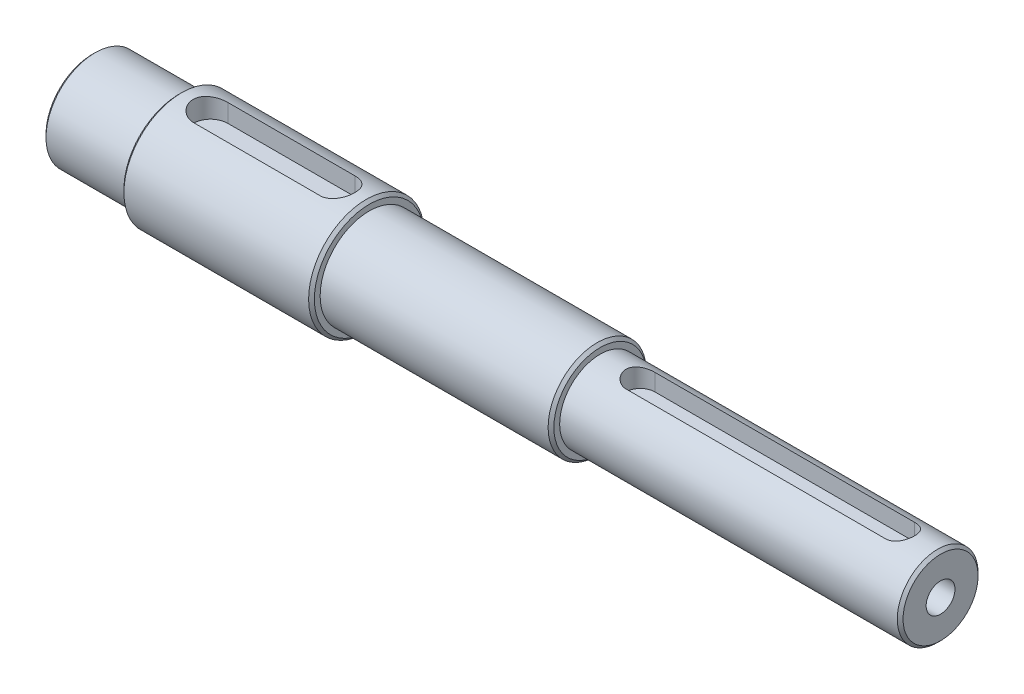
ISO-10303-21;
HEADER;
FILE_DESCRIPTION(('STEP AP214'),'2;1');
FILE_NAME('part.step','',(''),(''),'','','');
FILE_SCHEMA(('AUTOMOTIVE_DESIGN { 1 0 10303 214 1 1 1 1 }'));
ENDSEC;
DATA;
#1=APPLICATION_CONTEXT('core data for automotive mechanical design processes');
#2=APPLICATION_PROTOCOL_DEFINITION('international standard','automotive_design',2000,#1);
#3=PRODUCT_CONTEXT('',#1,'mechanical');
#4=PRODUCT('Part','Part','',(#3));
#5=PRODUCT_RELATED_PRODUCT_CATEGORY('part','',(#4));
#6=PRODUCT_DEFINITION_FORMATION('','',#4);
#7=PRODUCT_DEFINITION_CONTEXT('part definition',#1,'design');
#8=PRODUCT_DEFINITION('design','',#6,#7);
#9=PRODUCT_DEFINITION_SHAPE('','',#8);
#10=(LENGTH_UNIT() NAMED_UNIT(*) SI_UNIT(.MILLI.,.METRE.));
#11=(NAMED_UNIT(*) PLANE_ANGLE_UNIT() SI_UNIT($,.RADIAN.));
#12=(NAMED_UNIT(*) SI_UNIT($,.STERADIAN.) SOLID_ANGLE_UNIT());
#13=UNCERTAINTY_MEASURE_WITH_UNIT(LENGTH_MEASURE(1.E-05),#10,'distance_accuracy_value','');
#14=(GEOMETRIC_REPRESENTATION_CONTEXT(3) GLOBAL_UNCERTAINTY_ASSIGNED_CONTEXT((#13)) GLOBAL_UNIT_ASSIGNED_CONTEXT((#10,
#11,#12)) REPRESENTATION_CONTEXT('',''));
#15=CARTESIAN_POINT('',(0.,0.,0.));
#16=DIRECTION('',(0.,0.,1.));
#17=DIRECTION('',(1.,0.,0.));
#18=AXIS2_PLACEMENT_3D('',#15,#16,#17);
#19=CARTESIAN_POINT('',(-85.9026548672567,0.,0.));
#20=DIRECTION('',(-1.,0.,0.));
#21=DIRECTION('',(0.,0.,1.));
#22=AXIS2_PLACEMENT_3D('',#19,#20,#21);
#23=CYLINDRICAL_SURFACE('',#22,7.);
#24=CARTESIAN_POINT('',(68.2699115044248,0.,0.));
#25=DIRECTION('',(-1.,0.,0.));
#26=DIRECTION('',(0.,0.,1.));
#27=AXIS2_PLACEMENT_3D('',#24,#25,#26);
#28=CIRCLE('',#27,7.);
#29=CARTESIAN_POINT('',(68.2699115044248,0.,7.));
#30=VERTEX_POINT('',#29);
#31=EDGE_CURVE('E252',#30,#30,#28,.T.);
#32=ORIENTED_EDGE('',*,*,#31,.T.);
#33=EDGE_LOOP('',(#32));
#34=FACE_BOUND('',#33,.T.);
#35=CARTESIAN_POINT('',(9.76991150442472,0.,0.));
#36=DIRECTION('',(-1.,0.,0.));
#37=DIRECTION('',(0.,0.,1.));
#38=AXIS2_PLACEMENT_3D('',#35,#36,#37);
#39=CIRCLE('',#38,7.);
#40=CARTESIAN_POINT('',(9.76991150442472,0.,7.));
#41=VERTEX_POINT('',#40);
#42=EDGE_CURVE('E167',#41,#41,#39,.T.);
#43=ORIENTED_EDGE('',*,*,#42,.F.);
#44=EDGE_LOOP('',(#43));
#45=FACE_BOUND('',#44,.T.);
#46=CARTESIAN_POINT('',(16.7699115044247,6.53834841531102,-2.49999999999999));
#47=CARTESIAN_POINT('',(16.7020222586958,6.53833653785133,-2.50000932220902));
#48=CARTESIAN_POINT('',(16.6341395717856,6.53940549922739,-2.49723485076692));
#49=CARTESIAN_POINT('',(16.4989075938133,6.54361657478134,-2.48619102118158));
#50=CARTESIAN_POINT('',(16.4315581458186,6.54675805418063,-2.47792334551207));
#51=CARTESIAN_POINT('',(16.2980900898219,6.55501217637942,-2.45600175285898));
#52=CARTESIAN_POINT('',(16.2319681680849,6.56011831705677,-2.44236559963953));
#53=CARTESIAN_POINT('',(16.1012096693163,6.57213177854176,-2.40985115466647));
#54=CARTESIAN_POINT('',(16.0365731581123,6.57903917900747,-2.39097263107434));
#55=CARTESIAN_POINT('',(15.8456471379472,6.6021493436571,-2.32673964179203));
#56=CARTESIAN_POINT('',(15.7221210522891,6.62075475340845,-2.27375112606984));
#57=CARTESIAN_POINT('',(15.4856811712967,6.66225397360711,-2.14910757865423));
#58=CARTESIAN_POINT('',(15.3727751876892,6.68515090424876,-2.07743895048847));
#59=CARTESIAN_POINT('',(15.155696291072,6.73379913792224,-1.91402571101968));
#60=CARTESIAN_POINT('',(15.0520650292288,6.75962864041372,-1.82158337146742));
#61=CARTESIAN_POINT('',(14.8614027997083,6.81057592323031,-1.62073388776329));
#62=CARTESIAN_POINT('',(14.7743749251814,6.83569357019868,-1.51232377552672));
#63=CARTESIAN_POINT('',(14.6168216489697,6.88331133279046,-1.27853915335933));
#64=CARTESIAN_POINT('',(14.5468799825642,6.90570835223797,-1.15274833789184));
#65=CARTESIAN_POINT('',(14.4293748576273,6.94442357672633,-0.890250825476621));
#66=CARTESIAN_POINT('',(14.3818037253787,6.96074386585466,-0.753547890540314));
#67=CARTESIAN_POINT('',(14.3122709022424,6.98491050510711,-0.478829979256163));
#68=CARTESIAN_POINT('',(14.2893723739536,6.99306594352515,-0.341079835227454));
#69=CARTESIAN_POINT('',(14.2668431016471,7.00108798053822,-0.0634643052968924));
#70=CARTESIAN_POINT('',(14.2672059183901,7.00095687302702,0.0764004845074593));
#71=CARTESIAN_POINT('',(14.2906227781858,6.99262258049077,0.347593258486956));
#72=CARTESIAN_POINT('',(14.3126562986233,6.98478243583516,0.47902240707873));
#73=CARTESIAN_POINT('',(14.3770849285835,6.96237832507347,0.736175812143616));
#74=CARTESIAN_POINT('',(14.4194811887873,6.94781397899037,0.861899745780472));
#75=CARTESIAN_POINT('',(14.5239584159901,6.91316506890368,1.10616102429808));
#76=CARTESIAN_POINT('',(14.5863072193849,6.89300592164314,1.22457279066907));
#77=CARTESIAN_POINT('',(14.7286908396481,6.8492335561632,1.44953531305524));
#78=CARTESIAN_POINT('',(14.8087310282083,6.82561928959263,1.55608245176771));
#79=CARTESIAN_POINT('',(14.9892347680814,6.7759054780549,1.76032445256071));
#80=CARTESIAN_POINT('',(15.0905612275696,6.74974055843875,1.85724185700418));
#81=CARTESIAN_POINT('',(15.3082388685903,6.69890342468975,2.03299914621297));
#82=CARTESIAN_POINT('',(15.4245954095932,6.67423174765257,2.11183255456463));
#83=CARTESIAN_POINT('',(15.6718541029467,6.62877803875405,2.25049860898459));
#84=CARTESIAN_POINT('',(15.8029904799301,6.60807875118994,2.30994207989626));
#85=CARTESIAN_POINT('',(16.0742763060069,6.57388213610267,2.4055543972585));
#86=CARTESIAN_POINT('',(16.2144106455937,6.56037307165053,2.44176119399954));
#87=CARTESIAN_POINT('',(16.4249420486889,6.54708542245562,2.47705497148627));
#88=CARTESIAN_POINT('',(16.4936478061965,6.54382010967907,2.48565347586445));
#89=CARTESIAN_POINT('',(16.6315266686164,6.53944910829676,2.49712352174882));
#90=CARTESIAN_POINT('',(16.7006991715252,6.53834103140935,2.50000139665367));
#91=CARTESIAN_POINT('',(16.7699115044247,6.53834841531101,2.5));
#92=B_SPLINE_CURVE_WITH_KNOTS('',3,(#46,#47,#48,#49,#50,#51,#52,#53,#54,#55,#56,#57,#58,#59,#60,
#61,#62,#63,#64,#65,#66,#67,#68,#69,#70,#71,#72,#73,#74,#75,#76,#77,#78,#79,#80,#81,#82,#83,#84,
#85,#86,#87,#88,#89,#90,#91),.UNSPECIFIED.,.F.,.F.,(4,2,2,2,2,2,2,2,2,2,2,2,2,2,2,2,2,2,2,2,2,2,
4),(0.,0.203591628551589,0.407120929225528,0.609982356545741,0.812852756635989,1.21793118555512,
1.6233052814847,2.0451597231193,2.46709267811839,2.9018839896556,3.33652604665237,
3.75400993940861,4.17137826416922,4.56998920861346,4.96862268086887,5.37284909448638,
5.7771984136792,6.20315837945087,6.62927065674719,7.06347329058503,7.49696496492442,
7.7046858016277,7.91217653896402),.UNSPECIFIED.);
#93=CARTESIAN_POINT('',(16.7699115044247,6.53834841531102,-2.49999999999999));
#94=VERTEX_POINT('',#93);
#95=CARTESIAN_POINT('',(16.7699115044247,6.538348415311,2.5));
#96=VERTEX_POINT('',#95);
#97=EDGE_CURVE('E246',#94,#96,#92,.T.);
#98=ORIENTED_EDGE('',*,*,#97,.F.);
#99=DIRECTION('',(-1.,0.,0.));
#100=VECTOR('',#99,1.);
#101=CARTESIAN_POINT('',(-85.9026548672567,6.53834841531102,-2.49999999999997));
#102=LINE('',#101,#100);
#103=CARTESIAN_POINT('',(61.7699115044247,6.53834841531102,-2.49999999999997));
#104=VERTEX_POINT('',#103);
#105=EDGE_CURVE('E217',#104,#94,#102,.T.);
#106=ORIENTED_EDGE('',*,*,#105,.F.);
#107=CARTESIAN_POINT('',(61.7699115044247,6.53834841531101,2.5));
#108=CARTESIAN_POINT('',(61.8378007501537,6.53833653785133,2.50000932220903));
#109=CARTESIAN_POINT('',(61.9056834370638,6.53940549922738,2.49723485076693));
#110=CARTESIAN_POINT('',(62.0409154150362,6.54361657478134,2.48619102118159));
#111=CARTESIAN_POINT('',(62.1082648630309,6.54675805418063,2.47792334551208));
#112=CARTESIAN_POINT('',(62.2417329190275,6.55501217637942,2.45600175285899));
#113=CARTESIAN_POINT('',(62.3078548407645,6.56011831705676,2.44236559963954));
#114=CARTESIAN_POINT('',(62.4386133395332,6.57213177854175,2.40985115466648));
#115=CARTESIAN_POINT('',(62.5032498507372,6.57903917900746,2.39097263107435));
#116=CARTESIAN_POINT('',(62.6941758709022,6.6021493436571,2.32673964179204));
#117=CARTESIAN_POINT('',(62.8177019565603,6.62075475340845,2.27375112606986));
#118=CARTESIAN_POINT('',(63.0541418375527,6.6622539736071,2.14910757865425));
#119=CARTESIAN_POINT('',(63.1670478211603,6.68515090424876,2.07743895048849));
#120=CARTESIAN_POINT('',(63.3841267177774,6.73379913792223,1.9140257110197));
#121=CARTESIAN_POINT('',(63.4877579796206,6.75962864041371,1.82158337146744));
#122=CARTESIAN_POINT('',(63.6784202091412,6.81057592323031,1.6207338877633));
#123=CARTESIAN_POINT('',(63.7654480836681,6.83569357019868,1.51232377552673));
#124=CARTESIAN_POINT('',(63.9230013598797,6.88331133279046,1.27853915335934));
#125=CARTESIAN_POINT('',(63.9929430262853,6.90570835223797,1.15274833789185));
#126=CARTESIAN_POINT('',(64.1104481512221,6.94442357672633,0.890250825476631));
#127=CARTESIAN_POINT('',(64.1580192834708,6.96074386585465,0.753547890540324));
#128=CARTESIAN_POINT('',(64.2275521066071,6.9849105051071,0.478829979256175));
#129=CARTESIAN_POINT('',(64.2504506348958,6.99306594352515,0.341079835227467));
#130=CARTESIAN_POINT('',(64.2729799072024,7.00108798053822,0.0634643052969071));
#131=CARTESIAN_POINT('',(64.2726170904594,7.00095687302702,-0.0764004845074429));
#132=CARTESIAN_POINT('',(64.2492002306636,6.99262258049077,-0.347593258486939));
#133=CARTESIAN_POINT('',(64.2271667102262,6.98478243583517,-0.479022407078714));
#134=CARTESIAN_POINT('',(64.1627380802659,6.96237832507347,-0.736175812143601));
#135=CARTESIAN_POINT('',(64.1203418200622,6.94781397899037,-0.861899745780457));
#136=CARTESIAN_POINT('',(64.0158645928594,6.91316506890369,-1.10616102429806));
#137=CARTESIAN_POINT('',(63.9535157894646,6.89300592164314,-1.22457279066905));
#138=CARTESIAN_POINT('',(63.8111321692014,6.84923355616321,-1.44953531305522));
#139=CARTESIAN_POINT('',(63.7310919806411,6.82561928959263,-1.55608245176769));
#140=CARTESIAN_POINT('',(63.550588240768,6.7759054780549,-1.76032445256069));
#141=CARTESIAN_POINT('',(63.4492617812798,6.74974055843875,-1.85724185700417));
#142=CARTESIAN_POINT('',(63.2315841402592,6.69890342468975,-2.03299914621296));
#143=CARTESIAN_POINT('',(63.1152275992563,6.67423174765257,-2.11183255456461));
#144=CARTESIAN_POINT('',(62.8679689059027,6.62877803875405,-2.25049860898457));
#145=CARTESIAN_POINT('',(62.7368325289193,6.60807875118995,-2.30994207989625));
#146=CARTESIAN_POINT('',(62.4655467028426,6.57388213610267,-2.40555439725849));
#147=CARTESIAN_POINT('',(62.3254123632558,6.56037307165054,-2.44176119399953));
#148=CARTESIAN_POINT('',(62.1148809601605,6.54708542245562,-2.47705497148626));
#149=CARTESIAN_POINT('',(62.0461752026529,6.54382010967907,-2.48565347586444));
#150=CARTESIAN_POINT('',(61.908296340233,6.53944910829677,-2.49712352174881));
#151=CARTESIAN_POINT('',(61.8391238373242,6.53834103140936,-2.50000139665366));
#152=CARTESIAN_POINT('',(61.7699115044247,6.53834841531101,-2.49999999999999));
#153=B_SPLINE_CURVE_WITH_KNOTS('',3,(#107,#108,#109,#110,#111,#112,#113,#114,#115,#116,#117,
#118,#119,#120,#121,#122,#123,#124,#125,#126,#127,#128,#129,#130,#131,#132,#133,#134,#135,#136,
#137,#138,#139,#140,#141,#142,#143,#144,#145,#146,#147,#148,#149,#150,#151,#152),.UNSPECIFIED.,
.F.,.F.,(4,2,2,2,2,2,2,2,2,2,2,2,2,2,2,2,2,2,2,2,2,2,4),(0.,0.203591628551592,0.407120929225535,
0.609982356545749,0.812852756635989,1.21793118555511,1.62330528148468,2.04515972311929,
2.46709267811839,2.9018839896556,3.33652604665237,3.7540099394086,4.17137826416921,
4.56998920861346,4.96862268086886,5.37284909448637,5.7771984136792,6.20315837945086,
6.62927065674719,7.06347329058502,7.49696496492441,7.70468580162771,7.91217653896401),.UNSPECIFIED.);
#154=CARTESIAN_POINT('',(61.7699115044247,6.53834841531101,2.5));
#155=VERTEX_POINT('',#154);
#156=EDGE_CURVE('E219',#155,#104,#153,.T.);
#157=ORIENTED_EDGE('',*,*,#156,.F.);
#158=DIRECTION('',(-1.,0.,0.));
#159=VECTOR('',#158,1.);
#160=CARTESIAN_POINT('',(-85.9026548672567,6.538348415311,2.50000000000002));
#161=LINE('',#160,#159);
#162=EDGE_CURVE('E227',#96,#155,#161,.F.);
#163=ORIENTED_EDGE('',*,*,#162,.F.);
#164=EDGE_LOOP('',(#98,#106,#157,#163));
#165=FACE_BOUND('',#164,.T.);
#166=ADVANCED_FACE('F48',(#34,#45,#165),#23,.T.);
#167=CARTESIAN_POINT('',(-78.2300884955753,0.,0.));
#168=DIRECTION('',(1.,0.,0.));
#169=DIRECTION('',(0.,0.,-1.));
#170=AXIS2_PLACEMENT_3D('',#167,#168,#169);
#171=PLANE('',#170);
#172=CARTESIAN_POINT('',(-78.2300884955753,0.,0.));
#173=DIRECTION('',(1.,0.,0.));
#174=DIRECTION('',(0.,0.,-1.));
#175=AXIS2_PLACEMENT_3D('',#172,#173,#174);
#176=CIRCLE('',#175,7.99999999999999);
#177=CARTESIAN_POINT('',(-78.2300884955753,0.,-7.99999999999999));
#178=VERTEX_POINT('',#177);
#179=EDGE_CURVE('E57',#178,#178,#176,.F.);
#180=ORIENTED_EDGE('',*,*,#179,.T.);
#181=EDGE_LOOP('',(#180));
#182=FACE_BOUND('',#181,.T.);
#183=ADVANCED_FACE('F278',(#182),#171,.F.);
#184=CARTESIAN_POINT('',(-85.9026548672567,0.,0.));
#185=DIRECTION('',(-1.,0.,0.));
#186=DIRECTION('',(0.,0.,1.));
#187=AXIS2_PLACEMENT_3D('',#184,#185,#186);
#188=CYLINDRICAL_SURFACE('',#187,8.5);
#189=CARTESIAN_POINT('',(-77.7300884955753,0.,0.));
#190=DIRECTION('',(1.,0.,0.));
#191=DIRECTION('',(0.,0.,-1.));
#192=AXIS2_PLACEMENT_3D('',#189,#190,#191);
#193=CIRCLE('',#192,8.5);
#194=CARTESIAN_POINT('',(-77.7300884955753,0.,-8.5));
#195=VERTEX_POINT('',#194);
#196=EDGE_CURVE('E11',#195,#195,#193,.T.);
#197=ORIENTED_EDGE('',*,*,#196,.T.);
#198=EDGE_LOOP('',(#197));
#199=FACE_BOUND('',#198,.T.);
#200=CARTESIAN_POINT('',(-63.2300884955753,0.,0.));
#201=DIRECTION('',(-1.,0.,0.));
#202=DIRECTION('',(0.,0.,1.));
#203=AXIS2_PLACEMENT_3D('',#200,#201,#202);
#204=CIRCLE('',#203,8.5);
#205=CARTESIAN_POINT('',(-63.2300884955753,0.,8.5));
#206=VERTEX_POINT('',#205);
#207=EDGE_CURVE('E173',#206,#206,#204,.T.);
#208=ORIENTED_EDGE('',*,*,#207,.T.);
#209=EDGE_LOOP('',(#208));
#210=FACE_BOUND('',#209,.T.);
#211=ADVANCED_FACE('F296',(#199,#210),#188,.T.);
#212=CARTESIAN_POINT('',(-63.2300884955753,8.5,0.));
#213=DIRECTION('',(1.,0.,0.));
#214=DIRECTION('',(0.,0.,-1.));
#215=AXIS2_PLACEMENT_3D('',#212,#213,#214);
#216=PLANE('',#215);
#217=CARTESIAN_POINT('',(-63.2300884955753,0.,0.));
#218=DIRECTION('',(1.,0.,0.));
#219=DIRECTION('',(0.,0.,-1.));
#220=AXIS2_PLACEMENT_3D('',#217,#218,#219);
#221=CIRCLE('',#220,9.50000000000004);
#222=CARTESIAN_POINT('',(-63.2300884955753,0.,-9.50000000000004));
#223=VERTEX_POINT('',#222);
#224=EDGE_CURVE('E273',#223,#223,#221,.F.);
#225=ORIENTED_EDGE('',*,*,#224,.T.);
#226=EDGE_LOOP('',(#225));
#227=FACE_BOUND('',#226,.T.);
#228=ORIENTED_EDGE('',*,*,#207,.F.);
#229=EDGE_LOOP('',(#228));
#230=FACE_BOUND('',#229,.T.);
#231=ADVANCED_FACE('F355',(#227,#230),#216,.F.);
#232=CARTESIAN_POINT('',(-85.9026548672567,0.,0.));
#233=DIRECTION('',(-1.,0.,0.));
#234=DIRECTION('',(0.,0.,1.));
#235=AXIS2_PLACEMENT_3D('',#232,#233,#234);
#236=CYLINDRICAL_SURFACE('',#235,10.);
#237=CARTESIAN_POINT('',(-30.7300884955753,0.,0.));
#238=DIRECTION('',(-1.,0.,0.));
#239=DIRECTION('',(0.,0.,1.));
#240=AXIS2_PLACEMENT_3D('',#237,#238,#239);
#241=CIRCLE('',#240,10.);
#242=CARTESIAN_POINT('',(-30.7300884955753,0.,10.));
#243=VERTEX_POINT('',#242);
#244=EDGE_CURVE('E267',#243,#243,#241,.T.);
#245=ORIENTED_EDGE('',*,*,#244,.T.);
#246=EDGE_LOOP('',(#245));
#247=FACE_BOUND('',#246,.T.);
#248=CARTESIAN_POINT('',(-62.7300884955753,0.,0.));
#249=DIRECTION('',(1.,0.,0.));
#250=DIRECTION('',(0.,0.,-1.));
#251=AXIS2_PLACEMENT_3D('',#248,#249,#250);
#252=CIRCLE('',#251,10.);
#253=CARTESIAN_POINT('',(-62.7300884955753,0.,-10.));
#254=VERTEX_POINT('',#253);
#255=EDGE_CURVE('E264',#254,#254,#252,.T.);
#256=ORIENTED_EDGE('',*,*,#255,.T.);
#257=EDGE_LOOP('',(#256));
#258=FACE_BOUND('',#257,.T.);
#259=CARTESIAN_POINT('',(-35.7300884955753,9.53939201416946,3.));
#260=CARTESIAN_POINT('',(-35.6477529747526,9.53938054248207,3.00001027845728));
#261=CARTESIAN_POINT('',(-35.5654240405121,9.54045772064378,2.99661062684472));
#262=CARTESIAN_POINT('',(-35.4013945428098,9.54470412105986,2.98307142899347));
#263=CARTESIAN_POINT('',(-35.3196938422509,9.54787287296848,2.97293339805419));
#264=CARTESIAN_POINT('',(-35.1577035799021,9.55620668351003,2.94603140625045));
#265=CARTESIAN_POINT('',(-35.0774109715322,9.56136667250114,2.92928426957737));
#266=CARTESIAN_POINT('',(-34.9186126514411,9.57351626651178,2.88932853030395));
#267=CARTESIAN_POINT('',(-34.8401069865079,9.58050591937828,2.86611975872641));
#268=CARTESIAN_POINT('',(-34.6081391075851,9.60391637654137,2.78708584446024));
#269=CARTESIAN_POINT('',(-34.4580200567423,9.62279007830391,2.72181852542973));
#270=CARTESIAN_POINT('',(-34.1708624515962,9.66493213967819,2.56815043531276));
#271=CARTESIAN_POINT('',(-34.0338300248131,9.6882025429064,2.4797388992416));
#272=CARTESIAN_POINT('',(-33.7723655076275,9.73733650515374,2.27929879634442));
#273=CARTESIAN_POINT('',(-33.6484036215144,9.76325505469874,2.16666914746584));
#274=CARTESIAN_POINT('',(-33.4208148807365,9.81429628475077,1.92227736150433));
#275=CARTESIAN_POINT('',(-33.3171914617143,9.8394188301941,1.79051199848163));
#276=CARTESIAN_POINT('',(-33.1311616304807,9.88666477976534,1.50821997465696));
#277=CARTESIAN_POINT('',(-33.0492383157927,9.90871541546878,1.35736167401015));
#278=CARTESIAN_POINT('',(-32.9121114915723,9.94668940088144,1.04324233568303));
#279=CARTESIAN_POINT('',(-32.8569010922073,9.96261433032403,0.879984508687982));
#280=CARTESIAN_POINT('',(-32.7763289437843,9.98615279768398,0.550649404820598));
#281=CARTESIAN_POINT('',(-32.7501587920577,9.99399098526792,0.3847862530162));
#282=CARTESIAN_POINT('',(-32.7258538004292,10.0012640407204,0.0508471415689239));
#283=CARTESIAN_POINT('',(-32.7277136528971,10.0007004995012,-0.117228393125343));
#284=CARTESIAN_POINT('',(-32.7588743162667,9.99139205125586,-0.445143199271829));
#285=CARTESIAN_POINT('',(-32.7872991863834,9.98290831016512,-0.605074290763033));
#286=CARTESIAN_POINT('',(-32.8693517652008,9.95903027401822,-0.91778010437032));
#287=CARTESIAN_POINT('',(-32.9229807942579,9.94363561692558,-1.0705544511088));
#288=CARTESIAN_POINT('',(-33.0545129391,9.90730429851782,-1.36669563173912));
#289=CARTESIAN_POINT('',(-33.1326917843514,9.88630511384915,-1.50993201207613));
#290=CARTESIAN_POINT('',(-33.3108856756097,9.84099249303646,-1.78153105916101));
#291=CARTESIAN_POINT('',(-33.410905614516,9.81667831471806,-1.90989038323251));
#292=CARTESIAN_POINT('',(-33.6344724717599,9.7662334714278,-2.15330901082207));
#293=CARTESIAN_POINT('',(-33.7587762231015,9.74006890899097,-2.26766702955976));
#294=CARTESIAN_POINT('',(-34.0250833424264,9.68968430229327,-2.47413538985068));
#295=CARTESIAN_POINT('',(-34.1670918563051,9.66546482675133,-2.56623924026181));
#296=CARTESIAN_POINT('',(-34.4666503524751,9.62154457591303,-2.72632814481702));
#297=CARTESIAN_POINT('',(-34.6243428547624,9.60189192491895,-2.79406012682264));
#298=CARTESIAN_POINT('',(-34.9495375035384,9.56991327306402,-2.90171772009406));
#299=CARTESIAN_POINT('',(-35.117024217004,9.55757606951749,-2.94168586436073));
#300=CARTESIAN_POINT('',(-35.3600782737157,9.54628064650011,-2.9780240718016));
#301=CARTESIAN_POINT('',(-35.4338699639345,9.54370312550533,-2.98626405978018));
#302=CARTESIAN_POINT('',(-35.5817914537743,9.54025857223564,-2.9972471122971));
#303=CARTESIAN_POINT('',(-35.655920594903,9.53938902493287,-2.99999825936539));
#304=CARTESIAN_POINT('',(-35.7300884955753,9.53939201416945,-3.00000000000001));
#305=B_SPLINE_CURVE_WITH_KNOTS('',3,(#259,#260,#261,#262,#263,#264,#265,#266,#267,#268,#269,
#270,#271,#272,#273,#274,#275,#276,#277,#278,#279,#280,#281,#282,#283,#284,#285,#286,#287,#288,
#289,#290,#291,#292,#293,#294,#295,#296,#297,#298,#299,#300,#301,#302,#303,#304),.UNSPECIFIED.,
.F.,.F.,(4,2,2,2,2,2,2,2,2,2,2,2,2,2,2,2,2,2,2,2,2,2,4),(0.,0.246918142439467,0.493780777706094,
0.740019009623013,0.986263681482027,1.47813347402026,1.97023245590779,2.47635119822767,
2.98255536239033,3.49922810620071,4.01576751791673,4.51753600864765,5.01920948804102,
5.50490358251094,5.99062312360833,6.48200583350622,6.97349873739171,7.48389234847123,
7.99443465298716,8.51013494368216,9.02504345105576,9.24774267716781,9.47011372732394),.UNSPECIFIED.);
#306=CARTESIAN_POINT('',(-35.7300884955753,9.53939201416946,3.));
#307=VERTEX_POINT('',#306);
#308=CARTESIAN_POINT('',(-35.7300884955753,9.53939201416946,-3.00000000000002));
#309=VERTEX_POINT('',#308);
#310=EDGE_CURVE('E208',#307,#309,#305,.T.);
#311=ORIENTED_EDGE('',*,*,#310,.F.);
#312=DIRECTION('',(-1.,0.,0.));
#313=VECTOR('',#312,1.);
#314=CARTESIAN_POINT('',(-85.9026548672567,9.53939201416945,3.00000000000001));
#315=LINE('',#314,#313);
#316=CARTESIAN_POINT('',(-57.7300884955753,9.53939201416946,3.));
#317=VERTEX_POINT('',#316);
#318=EDGE_CURVE('E214',#307,#317,#315,.T.);
#319=ORIENTED_EDGE('',*,*,#318,.T.);
#320=CARTESIAN_POINT('',(-57.7300884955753,9.53939201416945,-3.));
#321=CARTESIAN_POINT('',(-57.812424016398,9.53938054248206,-3.00001027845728));
#322=CARTESIAN_POINT('',(-57.8947529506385,9.54045772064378,-2.99661062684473));
#323=CARTESIAN_POINT('',(-58.0587824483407,9.54470412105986,-2.98307142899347));
#324=CARTESIAN_POINT('',(-58.1404831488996,9.54787287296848,-2.97293339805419));
#325=CARTESIAN_POINT('',(-58.3024734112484,9.55620668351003,-2.94603140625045));
#326=CARTESIAN_POINT('',(-58.3827660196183,9.56136667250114,-2.92928426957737));
#327=CARTESIAN_POINT('',(-58.5415643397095,9.57351626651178,-2.88932853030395));
#328=CARTESIAN_POINT('',(-58.6200700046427,9.58050591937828,-2.86611975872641));
#329=CARTESIAN_POINT('',(-58.8520378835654,9.60391637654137,-2.78708584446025));
#330=CARTESIAN_POINT('',(-59.0021569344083,9.62279007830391,-2.72181852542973));
#331=CARTESIAN_POINT('',(-59.2893145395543,9.66493213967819,-2.56815043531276));
#332=CARTESIAN_POINT('',(-59.4263469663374,9.68820254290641,-2.4797388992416));
#333=CARTESIAN_POINT('',(-59.6878114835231,9.73733650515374,-2.27929879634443));
#334=CARTESIAN_POINT('',(-59.8117733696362,9.76325505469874,-2.16666914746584));
#335=CARTESIAN_POINT('',(-60.039362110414,9.81429628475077,-1.92227736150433));
#336=CARTESIAN_POINT('',(-60.1429855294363,9.8394188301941,-1.79051199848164));
#337=CARTESIAN_POINT('',(-60.3290153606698,9.88666477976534,-1.50821997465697));
#338=CARTESIAN_POINT('',(-60.4109386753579,9.90871541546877,-1.35736167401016));
#339=CARTESIAN_POINT('',(-60.5480654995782,9.94668940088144,-1.04324233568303));
#340=CARTESIAN_POINT('',(-60.6032758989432,9.96261433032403,-0.879984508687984));
#341=CARTESIAN_POINT('',(-60.6838480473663,9.98615279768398,-0.5506494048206));
#342=CARTESIAN_POINT('',(-60.7100181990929,9.99399098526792,-0.384786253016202));
#343=CARTESIAN_POINT('',(-60.7343231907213,10.0012640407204,-0.0508471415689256));
#344=CARTESIAN_POINT('',(-60.7324633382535,10.0007004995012,0.117228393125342));
#345=CARTESIAN_POINT('',(-60.7013026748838,9.99139205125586,0.445143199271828));
#346=CARTESIAN_POINT('',(-60.6728778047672,9.98290831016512,0.605074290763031));
#347=CARTESIAN_POINT('',(-60.5908252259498,9.95903027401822,0.917780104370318));
#348=CARTESIAN_POINT('',(-60.5371961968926,9.94363561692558,1.07055445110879));
#349=CARTESIAN_POINT('',(-60.4056640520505,9.90730429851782,1.36669563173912));
#350=CARTESIAN_POINT('',(-60.3274852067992,9.88630511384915,1.50993201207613));
#351=CARTESIAN_POINT('',(-60.1492913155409,9.84099249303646,1.78153105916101));
#352=CARTESIAN_POINT('',(-60.0492713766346,9.81667831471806,1.90989038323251));
#353=CARTESIAN_POINT('',(-59.8257045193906,9.7662334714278,2.15330901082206));
#354=CARTESIAN_POINT('',(-59.7014007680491,9.74006890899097,2.26766702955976));
#355=CARTESIAN_POINT('',(-59.4350936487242,9.68968430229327,2.47413538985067));
#356=CARTESIAN_POINT('',(-59.2930851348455,9.66546482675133,2.56623924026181));
#357=CARTESIAN_POINT('',(-58.9935266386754,9.62154457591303,2.72632814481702));
#358=CARTESIAN_POINT('',(-58.8358341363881,9.60189192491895,2.79406012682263));
#359=CARTESIAN_POINT('',(-58.5106394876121,9.56991327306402,2.90171772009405));
#360=CARTESIAN_POINT('',(-58.3431527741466,9.55757606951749,2.94168586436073));
#361=CARTESIAN_POINT('',(-58.1000987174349,9.54628064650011,2.9780240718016));
#362=CARTESIAN_POINT('',(-58.026307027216,9.54370312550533,2.98626405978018));
#363=CARTESIAN_POINT('',(-57.8783855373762,9.54025857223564,2.99724711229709));
#364=CARTESIAN_POINT('',(-57.8042563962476,9.53938902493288,2.99999825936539));
#365=CARTESIAN_POINT('',(-57.7300884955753,9.53939201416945,3.00000000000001));
#366=B_SPLINE_CURVE_WITH_KNOTS('',3,(#320,#321,#322,#323,#324,#325,#326,#327,#328,#329,#330,
#331,#332,#333,#334,#335,#336,#337,#338,#339,#340,#341,#342,#343,#344,#345,#346,#347,#348,#349,
#350,#351,#352,#353,#354,#355,#356,#357,#358,#359,#360,#361,#362,#363,#364,#365),.UNSPECIFIED.,
.F.,.F.,(4,2,2,2,2,2,2,2,2,2,2,2,2,2,2,2,2,2,2,2,2,2,4),(0.,0.246918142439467,0.493780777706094,
0.740019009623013,0.986263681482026,1.47813347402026,1.97023245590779,2.47635119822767,
2.98255536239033,3.49922810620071,4.01576751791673,4.51753600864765,5.01920948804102,
5.50490358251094,5.99062312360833,6.48200583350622,6.97349873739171,7.48389234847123,
7.99443465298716,8.51013494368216,9.02504345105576,9.24774267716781,9.47011372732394),.UNSPECIFIED.);
#367=CARTESIAN_POINT('',(-57.7300884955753,9.53939201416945,-3.));
#368=VERTEX_POINT('',#367);
#369=EDGE_CURVE('E176',#368,#317,#366,.T.);
#370=ORIENTED_EDGE('',*,*,#369,.F.);
#371=DIRECTION('',(-1.,0.,0.));
#372=VECTOR('',#371,1.);
#373=CARTESIAN_POINT('',(-85.9026548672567,9.53939201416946,-3.));
#374=LINE('',#373,#372);
#375=EDGE_CURVE('E184',#368,#309,#374,.F.);
#376=ORIENTED_EDGE('',*,*,#375,.T.);
#377=EDGE_LOOP('',(#311,#319,#370,#376));
#378=FACE_BOUND('',#377,.T.);
#379=ADVANCED_FACE('F186',(#247,#258,#378),#236,.T.);
#380=CARTESIAN_POINT('',(-30.2300884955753,10.,0.));
#381=DIRECTION('',(-1.,0.,0.));
#382=DIRECTION('',(0.,0.,1.));
#383=AXIS2_PLACEMENT_3D('',#380,#381,#382);
#384=PLANE('',#383);
#385=CARTESIAN_POINT('',(-30.2300884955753,0.,0.));
#386=DIRECTION('',(-1.,0.,0.));
#387=DIRECTION('',(0.,0.,1.));
#388=AXIS2_PLACEMENT_3D('',#385,#386,#387);
#389=CIRCLE('',#388,9.49999999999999);
#390=CARTESIAN_POINT('',(-30.2300884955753,0.,9.49999999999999));
#391=VERTEX_POINT('',#390);
#392=EDGE_CURVE('E270',#391,#391,#389,.F.);
#393=ORIENTED_EDGE('',*,*,#392,.T.);
#394=EDGE_LOOP('',(#393));
#395=FACE_BOUND('',#394,.T.);
#396=CARTESIAN_POINT('',(-30.2300884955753,0.,0.));
#397=DIRECTION('',(-1.,0.,0.));
#398=DIRECTION('',(0.,0.,1.));
#399=AXIS2_PLACEMENT_3D('',#396,#397,#398);
#400=CIRCLE('',#399,8.5);
#401=CARTESIAN_POINT('',(-30.2300884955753,0.,8.5));
#402=VERTEX_POINT('',#401);
#403=EDGE_CURVE('E170',#402,#402,#400,.T.);
#404=ORIENTED_EDGE('',*,*,#403,.T.);
#405=EDGE_LOOP('',(#404));
#406=FACE_BOUND('',#405,.T.);
#407=ADVANCED_FACE('F346',(#395,#406),#384,.F.);
#408=CARTESIAN_POINT('',(-85.9026548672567,0.,0.));
#409=DIRECTION('',(-1.,0.,0.));
#410=DIRECTION('',(0.,0.,1.));
#411=AXIS2_PLACEMENT_3D('',#408,#409,#410);
#412=CYLINDRICAL_SURFACE('',#411,8.5);
#413=CARTESIAN_POINT('',(9.26991150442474,0.,0.));
#414=DIRECTION('',(-1.,0.,0.));
#415=DIRECTION('',(0.,0.,1.));
#416=AXIS2_PLACEMENT_3D('',#413,#414,#415);
#417=CIRCLE('',#416,8.5);
#418=CARTESIAN_POINT('',(9.26991150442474,0.,8.5));
#419=VERTEX_POINT('',#418);
#420=EDGE_CURVE('E258',#419,#419,#417,.T.);
#421=ORIENTED_EDGE('',*,*,#420,.T.);
#422=EDGE_LOOP('',(#421));
#423=FACE_BOUND('',#422,.T.);
#424=ORIENTED_EDGE('',*,*,#403,.F.);
#425=EDGE_LOOP('',(#424));
#426=FACE_BOUND('',#425,.T.);
#427=ADVANCED_FACE('F341',(#423,#426),#412,.T.);
#428=CARTESIAN_POINT('',(9.76991150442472,8.5,0.));
#429=DIRECTION('',(-1.,0.,0.));
#430=DIRECTION('',(0.,0.,1.));
#431=AXIS2_PLACEMENT_3D('',#428,#429,#430);
#432=PLANE('',#431);
#433=CARTESIAN_POINT('',(9.76991150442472,0.,0.));
#434=DIRECTION('',(-1.,0.,0.));
#435=DIRECTION('',(0.,0.,1.));
#436=AXIS2_PLACEMENT_3D('',#433,#434,#435);
#437=CIRCLE('',#436,8.00000000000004);
#438=CARTESIAN_POINT('',(9.76991150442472,0.,8.00000000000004));
#439=VERTEX_POINT('',#438);
#440=EDGE_CURVE('E261',#439,#439,#437,.F.);
#441=ORIENTED_EDGE('',*,*,#440,.T.);
#442=EDGE_LOOP('',(#441));
#443=FACE_BOUND('',#442,.T.);
#444=ORIENTED_EDGE('',*,*,#42,.T.);
#445=EDGE_LOOP('',(#444));
#446=FACE_BOUND('',#445,.T.);
#447=ADVANCED_FACE('F334',(#443,#446),#432,.F.);
#448=CARTESIAN_POINT('',(68.7699115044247,7.,0.));
#449=DIRECTION('',(-1.,0.,0.));
#450=DIRECTION('',(0.,0.,1.));
#451=AXIS2_PLACEMENT_3D('',#448,#449,#450);
#452=PLANE('',#451);
#453=CARTESIAN_POINT('',(68.7699115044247,0.,0.));
#454=DIRECTION('',(1.,0.,0.));
#455=DIRECTION('',(0.,0.,-1.));
#456=AXIS2_PLACEMENT_3D('',#453,#454,#455);
#457=CIRCLE('',#456,2.5);
#458=CARTESIAN_POINT('',(68.7699115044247,0.,-2.5));
#459=VERTEX_POINT('',#458);
#460=EDGE_CURVE('E125',#459,#459,#457,.T.);
#461=ORIENTED_EDGE('',*,*,#460,.F.);
#462=EDGE_LOOP('',(#461));
#463=FACE_BOUND('',#462,.T.);
#464=CARTESIAN_POINT('',(68.7699115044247,0.,0.));
#465=DIRECTION('',(-1.,0.,0.));
#466=DIRECTION('',(0.,0.,1.));
#467=AXIS2_PLACEMENT_3D('',#464,#465,#466);
#468=CIRCLE('',#467,6.50000000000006);
#469=CARTESIAN_POINT('',(68.7699115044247,0.,6.50000000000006));
#470=VERTEX_POINT('',#469);
#471=EDGE_CURVE('E255',#470,#470,#468,.F.);
#472=ORIENTED_EDGE('',*,*,#471,.T.);
#473=EDGE_LOOP('',(#472));
#474=FACE_BOUND('',#473,.T.);
#475=ADVANCED_FACE('F332',(#463,#474),#452,.F.);
#476=CARTESIAN_POINT('',(0.,16.4,2.99999999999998));
#477=DIRECTION('',(0.,0.,1.));
#478=DIRECTION('',(1.,0.,0.));
#479=AXIS2_PLACEMENT_3D('',#476,#477,#478);
#480=PLANE('',#479);
#481=DIRECTION('',(0.,-1.,0.));
#482=VECTOR('',#481,1.);
#483=CARTESIAN_POINT('',(-35.7300884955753,16.4,3.));
#484=LINE('',#483,#482);
#485=CARTESIAN_POINT('',(-35.7300884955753,6.4,3.));
#486=VERTEX_POINT('',#485);
#487=EDGE_CURVE('E165',#307,#486,#484,.T.);
#488=ORIENTED_EDGE('',*,*,#487,.T.);
#489=DIRECTION('',(-1.,0.,0.));
#490=VECTOR('',#489,1.);
#491=CARTESIAN_POINT('',(0.,6.4,2.99999999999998));
#492=LINE('',#491,#490);
#493=CARTESIAN_POINT('',(-57.7300884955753,6.4,3.));
#494=VERTEX_POINT('',#493);
#495=EDGE_CURVE('E148',#486,#494,#492,.T.);
#496=ORIENTED_EDGE('',*,*,#495,.T.);
#497=DIRECTION('',(0.,-1.,0.));
#498=VECTOR('',#497,1.);
#499=CARTESIAN_POINT('',(-57.7300884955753,16.4,3.));
#500=LINE('',#499,#498);
#501=EDGE_CURVE('E160',#317,#494,#500,.T.);
#502=ORIENTED_EDGE('',*,*,#501,.F.);
#503=ORIENTED_EDGE('',*,*,#318,.F.);
#504=EDGE_LOOP('',(#488,#496,#502,#503));
#505=FACE_BOUND('',#504,.T.);
#506=ADVANCED_FACE('F205',(#505),#480,.F.);
#507=CARTESIAN_POINT('',(-35.7300884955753,16.4,0.));
#508=DIRECTION('',(0.,-1.,0.));
#509=DIRECTION('',(0.,0.,-1.));
#510=AXIS2_PLACEMENT_3D('',#507,#508,#509);
#511=CYLINDRICAL_SURFACE('',#510,3.00000000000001);
#512=ORIENTED_EDGE('',*,*,#310,.T.);
#513=DIRECTION('',(0.,-1.,0.));
#514=VECTOR('',#513,1.);
#515=CARTESIAN_POINT('',(-35.7300884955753,16.4,-3.00000000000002));
#516=LINE('',#515,#514);
#517=CARTESIAN_POINT('',(-35.7300884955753,6.4,-3.00000000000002));
#518=VERTEX_POINT('',#517);
#519=EDGE_CURVE('E163',#309,#518,#516,.T.);
#520=ORIENTED_EDGE('',*,*,#519,.T.);
#521=CARTESIAN_POINT('',(-35.7300884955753,6.4,0.));
#522=DIRECTION('',(0.,1.,0.));
#523=DIRECTION('',(0.,0.,1.));
#524=AXIS2_PLACEMENT_3D('',#521,#522,#523);
#525=CIRCLE('',#524,3.00000000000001);
#526=EDGE_CURVE('E151',#486,#518,#525,.T.);
#527=ORIENTED_EDGE('',*,*,#526,.F.);
#528=ORIENTED_EDGE('',*,*,#487,.F.);
#529=EDGE_LOOP('',(#512,#520,#527,#528));
#530=FACE_BOUND('',#529,.T.);
#531=ADVANCED_FACE('F200',(#530),#511,.F.);
#532=CARTESIAN_POINT('',(0.,16.4,-3.00000000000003));
#533=DIRECTION('',(0.,0.,-1.));
#534=DIRECTION('',(-1.,0.,0.));
#535=AXIS2_PLACEMENT_3D('',#532,#533,#534);
#536=PLANE('',#535);
#537=DIRECTION('',(0.,-1.,0.));
#538=VECTOR('',#537,1.);
#539=CARTESIAN_POINT('',(-57.7300884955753,16.4,-3.00000000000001));
#540=LINE('',#539,#538);
#541=CARTESIAN_POINT('',(-57.7300884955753,6.4,-3.00000000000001));
#542=VERTEX_POINT('',#541);
#543=EDGE_CURVE('E72',#368,#542,#540,.T.);
#544=ORIENTED_EDGE('',*,*,#543,.T.);
#545=DIRECTION('',(1.,0.,0.));
#546=VECTOR('',#545,1.);
#547=CARTESIAN_POINT('',(0.,6.4,-3.00000000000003));
#548=LINE('',#547,#546);
#549=EDGE_CURVE('E154',#542,#518,#548,.T.);
#550=ORIENTED_EDGE('',*,*,#549,.T.);
#551=ORIENTED_EDGE('',*,*,#519,.F.);
#552=ORIENTED_EDGE('',*,*,#375,.F.);
#553=EDGE_LOOP('',(#544,#550,#551,#552));
#554=FACE_BOUND('',#553,.T.);
#555=ADVANCED_FACE('F196',(#554),#536,.F.);
#556=CARTESIAN_POINT('',(-57.7300884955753,16.4,0.));
#557=DIRECTION('',(0.,-1.,0.));
#558=DIRECTION('',(0.,0.,-1.));
#559=AXIS2_PLACEMENT_3D('',#556,#557,#558);
#560=CYLINDRICAL_SURFACE('',#559,3.00000000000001);
#561=ORIENTED_EDGE('',*,*,#369,.T.);
#562=ORIENTED_EDGE('',*,*,#501,.T.);
#563=CARTESIAN_POINT('',(-57.7300884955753,6.4,0.));
#564=DIRECTION('',(0.,1.,0.));
#565=DIRECTION('',(0.,0.,1.));
#566=AXIS2_PLACEMENT_3D('',#563,#564,#565);
#567=CIRCLE('',#566,3.00000000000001);
#568=EDGE_CURVE('E157',#542,#494,#567,.T.);
#569=ORIENTED_EDGE('',*,*,#568,.F.);
#570=ORIENTED_EDGE('',*,*,#543,.F.);
#571=EDGE_LOOP('',(#561,#562,#569,#570));
#572=FACE_BOUND('',#571,.T.);
#573=ADVANCED_FACE('F190',(#572),#560,.F.);
#574=CARTESIAN_POINT('',(0.,6.4,0.));
#575=DIRECTION('',(0.,1.,0.));
#576=DIRECTION('',(0.,0.,1.));
#577=AXIS2_PLACEMENT_3D('',#574,#575,#576);
#578=PLANE('',#577);
#579=ORIENTED_EDGE('',*,*,#495,.F.);
#580=ORIENTED_EDGE('',*,*,#526,.T.);
#581=ORIENTED_EDGE('',*,*,#549,.F.);
#582=ORIENTED_EDGE('',*,*,#568,.T.);
#583=EDGE_LOOP('',(#579,#580,#581,#582));
#584=FACE_BOUND('',#583,.T.);
#585=ADVANCED_FACE('F195',(#584),#578,.T.);
#586=CARTESIAN_POINT('',(16.7699115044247,13.6,0.));
#587=DIRECTION('',(0.,-1.,0.));
#588=DIRECTION('',(0.,0.,-1.));
#589=AXIS2_PLACEMENT_3D('',#586,#587,#588);
#590=CYLINDRICAL_SURFACE('',#589,2.49999999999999);
#591=ORIENTED_EDGE('',*,*,#97,.T.);
#592=DIRECTION('',(0.,-1.,0.));
#593=VECTOR('',#592,1.);
#594=CARTESIAN_POINT('',(16.7699115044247,13.6,2.5));
#595=LINE('',#594,#593);
#596=CARTESIAN_POINT('',(16.7699115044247,3.6,2.5));
#597=VERTEX_POINT('',#596);
#598=EDGE_CURVE('E146',#96,#597,#595,.T.);
#599=ORIENTED_EDGE('',*,*,#598,.T.);
#600=CARTESIAN_POINT('',(16.7699115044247,3.6,0.));
#601=DIRECTION('',(0.,1.,0.));
#602=DIRECTION('',(0.,0.,1.));
#603=AXIS2_PLACEMENT_3D('',#600,#601,#602);
#604=CIRCLE('',#603,2.49999999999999);
#605=CARTESIAN_POINT('',(16.7699115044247,3.6,-2.49999999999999));
#606=VERTEX_POINT('',#605);
#607=EDGE_CURVE('E124',#606,#597,#604,.T.);
#608=ORIENTED_EDGE('',*,*,#607,.F.);
#609=DIRECTION('',(0.,-1.,0.));
#610=VECTOR('',#609,1.);
#611=CARTESIAN_POINT('',(16.7699115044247,13.6,-2.49999999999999));
#612=LINE('',#611,#610);
#613=EDGE_CURVE('E141',#94,#606,#612,.T.);
#614=ORIENTED_EDGE('',*,*,#613,.F.);
#615=EDGE_LOOP('',(#591,#599,#608,#614));
#616=FACE_BOUND('',#615,.T.);
#617=ADVANCED_FACE('F241',(#616),#590,.F.);
#618=CARTESIAN_POINT('',(16.7699115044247,13.6,2.5));
#619=DIRECTION('',(0.,0.,-1.));
#620=DIRECTION('',(-1.,0.,0.));
#621=AXIS2_PLACEMENT_3D('',#618,#619,#620);
#622=PLANE('',#621);
#623=ORIENTED_EDGE('',*,*,#162,.T.);
#624=DIRECTION('',(0.,-1.,0.));
#625=VECTOR('',#624,1.);
#626=CARTESIAN_POINT('',(61.7699115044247,13.6,2.5));
#627=LINE('',#626,#625);
#628=CARTESIAN_POINT('',(61.7699115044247,3.6,2.5));
#629=VERTEX_POINT('',#628);
#630=EDGE_CURVE('E144',#155,#629,#627,.T.);
#631=ORIENTED_EDGE('',*,*,#630,.T.);
#632=DIRECTION('',(1.,0.,0.));
#633=VECTOR('',#632,1.);
#634=CARTESIAN_POINT('',(16.7699115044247,3.6,2.5));
#635=LINE('',#634,#633);
#636=EDGE_CURVE('E128',#597,#629,#635,.T.);
#637=ORIENTED_EDGE('',*,*,#636,.F.);
#638=ORIENTED_EDGE('',*,*,#598,.F.);
#639=EDGE_LOOP('',(#623,#631,#637,#638));
#640=FACE_BOUND('',#639,.T.);
#641=ADVANCED_FACE('F237',(#640),#622,.T.);
#642=CARTESIAN_POINT('',(61.7699115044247,13.6,0.));
#643=DIRECTION('',(0.,-1.,0.));
#644=DIRECTION('',(0.,0.,-1.));
#645=AXIS2_PLACEMENT_3D('',#642,#643,#644);
#646=CYLINDRICAL_SURFACE('',#645,2.49999999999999);
#647=ORIENTED_EDGE('',*,*,#156,.T.);
#648=DIRECTION('',(0.,-1.,0.));
#649=VECTOR('',#648,1.);
#650=CARTESIAN_POINT('',(61.7699115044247,13.6,-2.49999999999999));
#651=LINE('',#650,#649);
#652=CARTESIAN_POINT('',(61.7699115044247,3.6,-2.49999999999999));
#653=VERTEX_POINT('',#652);
#654=EDGE_CURVE('E64',#104,#653,#651,.T.);
#655=ORIENTED_EDGE('',*,*,#654,.T.);
#656=CARTESIAN_POINT('',(61.7699115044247,3.6,0.));
#657=DIRECTION('',(0.,1.,0.));
#658=DIRECTION('',(0.,0.,1.));
#659=AXIS2_PLACEMENT_3D('',#656,#657,#658);
#660=CIRCLE('',#659,2.49999999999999);
#661=EDGE_CURVE('E135',#629,#653,#660,.T.);
#662=ORIENTED_EDGE('',*,*,#661,.F.);
#663=ORIENTED_EDGE('',*,*,#630,.F.);
#664=EDGE_LOOP('',(#647,#655,#662,#663));
#665=FACE_BOUND('',#664,.T.);
#666=ADVANCED_FACE('F231',(#665),#646,.F.);
#667=CARTESIAN_POINT('',(16.7699115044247,13.6,-2.49999999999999));
#668=DIRECTION('',(0.,0.,1.));
#669=DIRECTION('',(1.,0.,0.));
#670=AXIS2_PLACEMENT_3D('',#667,#668,#669);
#671=PLANE('',#670);
#672=ORIENTED_EDGE('',*,*,#105,.T.);
#673=ORIENTED_EDGE('',*,*,#613,.T.);
#674=DIRECTION('',(-1.,0.,0.));
#675=VECTOR('',#674,1.);
#676=CARTESIAN_POINT('',(16.7699115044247,3.6,-2.49999999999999));
#677=LINE('',#676,#675);
#678=EDGE_CURVE('E138',#653,#606,#677,.T.);
#679=ORIENTED_EDGE('',*,*,#678,.F.);
#680=ORIENTED_EDGE('',*,*,#654,.F.);
#681=EDGE_LOOP('',(#672,#673,#679,#680));
#682=FACE_BOUND('',#681,.T.);
#683=ADVANCED_FACE('F236',(#682),#671,.T.);
#684=CARTESIAN_POINT('',(16.7699115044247,3.6,0.));
#685=DIRECTION('',(0.,1.,0.));
#686=DIRECTION('',(0.,0.,1.));
#687=AXIS2_PLACEMENT_3D('',#684,#685,#686);
#688=PLANE('',#687);
#689=ORIENTED_EDGE('',*,*,#607,.T.);
#690=ORIENTED_EDGE('',*,*,#636,.T.);
#691=ORIENTED_EDGE('',*,*,#661,.T.);
#692=ORIENTED_EDGE('',*,*,#678,.T.);
#693=EDGE_LOOP('',(#689,#690,#691,#692));
#694=FACE_BOUND('',#693,.T.);
#695=ADVANCED_FACE('F313',(#694),#688,.T.);
#696=CARTESIAN_POINT('',(68.2699115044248,0.,0.));
#697=DIRECTION('',(-1.,0.,0.));
#698=DIRECTION('',(0.,0.,1.));
#699=AXIS2_PLACEMENT_3D('',#696,#697,#698);
#700=CONICAL_SURFACE('',#699,7.,0.785398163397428);
#701=ORIENTED_EDGE('',*,*,#471,.F.);
#702=EDGE_LOOP('',(#701));
#703=FACE_BOUND('',#702,.T.);
#704=ORIENTED_EDGE('',*,*,#31,.F.);
#705=EDGE_LOOP('',(#704));
#706=FACE_BOUND('',#705,.T.);
#707=ADVANCED_FACE('F317',(#703,#706),#700,.T.);
#708=CARTESIAN_POINT('',(9.26991150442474,0.,0.));
#709=DIRECTION('',(-1.,0.,0.));
#710=DIRECTION('',(0.,0.,1.));
#711=AXIS2_PLACEMENT_3D('',#708,#709,#710);
#712=CONICAL_SURFACE('',#711,8.5,0.785398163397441);
#713=ORIENTED_EDGE('',*,*,#440,.F.);
#714=EDGE_LOOP('',(#713));
#715=FACE_BOUND('',#714,.T.);
#716=ORIENTED_EDGE('',*,*,#420,.F.);
#717=EDGE_LOOP('',(#716));
#718=FACE_BOUND('',#717,.T.);
#719=ADVANCED_FACE('F321',(#715,#718),#712,.T.);
#720=CARTESIAN_POINT('',(-30.7300884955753,0.,0.));
#721=DIRECTION('',(-1.,0.,0.));
#722=DIRECTION('',(0.,0.,1.));
#723=AXIS2_PLACEMENT_3D('',#720,#721,#722);
#724=CONICAL_SURFACE('',#723,10.,0.785398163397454);
#725=ORIENTED_EDGE('',*,*,#392,.F.);
#726=EDGE_LOOP('',(#725));
#727=FACE_BOUND('',#726,.T.);
#728=ORIENTED_EDGE('',*,*,#244,.F.);
#729=EDGE_LOOP('',(#728));
#730=FACE_BOUND('',#729,.T.);
#731=ADVANCED_FACE('F287',(#727,#730),#724,.T.);
#732=CARTESIAN_POINT('',(-63.2300884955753,0.,0.));
#733=DIRECTION('',(1.,0.,0.));
#734=DIRECTION('',(0.,0.,-1.));
#735=AXIS2_PLACEMENT_3D('',#732,#733,#734);
#736=CONICAL_SURFACE('',#735,9.50000000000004,0.78539816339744);
#737=ORIENTED_EDGE('',*,*,#255,.F.);
#738=EDGE_LOOP('',(#737));
#739=FACE_BOUND('',#738,.T.);
#740=ORIENTED_EDGE('',*,*,#224,.F.);
#741=EDGE_LOOP('',(#740));
#742=FACE_BOUND('',#741,.T.);
#743=ADVANCED_FACE('F281',(#739,#742),#736,.T.);
#744=CARTESIAN_POINT('',(-78.2300884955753,0.,0.));
#745=DIRECTION('',(1.,0.,0.));
#746=DIRECTION('',(0.,0.,-1.));
#747=AXIS2_PLACEMENT_3D('',#744,#745,#746);
#748=CONICAL_SURFACE('',#747,7.99999999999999,0.785398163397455);
#749=ORIENTED_EDGE('',*,*,#196,.F.);
#750=EDGE_LOOP('',(#749));
#751=FACE_BOUND('',#750,.T.);
#752=ORIENTED_EDGE('',*,*,#179,.F.);
#753=EDGE_LOOP('',(#752));
#754=FACE_BOUND('',#753,.T.);
#755=ADVANCED_FACE('F51',(#751,#754),#748,.T.);
#756=CARTESIAN_POINT('',(53.7699115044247,0.,0.));
#757=DIRECTION('',(1.,0.,0.));
#758=DIRECTION('',(0.,0.,-1.));
#759=AXIS2_PLACEMENT_3D('',#756,#757,#758);
#760=CONICAL_SURFACE('',#759,2.5,1.02974425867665);
#761=CARTESIAN_POINT('',(52.2677599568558,0.,0.));
#762=VERTEX_POINT('',#761);
#763=VERTEX_LOOP('',#762);
#764=FACE_BOUND('',#763,.T.);
#765=CARTESIAN_POINT('',(53.7699115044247,0.,0.));
#766=DIRECTION('',(1.,0.,0.));
#767=DIRECTION('',(0.,0.,-1.));
#768=AXIS2_PLACEMENT_3D('',#765,#766,#767);
#769=CIRCLE('',#768,2.5);
#770=CARTESIAN_POINT('',(53.7699115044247,0.,-2.5));
#771=VERTEX_POINT('',#770);
#772=EDGE_CURVE('E122',#771,#771,#769,.T.);
#773=ORIENTED_EDGE('',*,*,#772,.T.);
#774=EDGE_LOOP('',(#773));
#775=FACE_BOUND('',#774,.T.);
#776=ADVANCED_FACE('F115',(#764,#775),#760,.F.);
#777=CARTESIAN_POINT('',(68.7699115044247,0.,0.));
#778=DIRECTION('',(1.,0.,0.));
#779=DIRECTION('',(0.,0.,-1.));
#780=AXIS2_PLACEMENT_3D('',#777,#778,#779);
#781=CYLINDRICAL_SURFACE('',#780,2.5);
#782=ORIENTED_EDGE('',*,*,#772,.F.);
#783=EDGE_LOOP('',(#782));
#784=FACE_BOUND('',#783,.T.);
#785=ORIENTED_EDGE('',*,*,#460,.T.);
#786=EDGE_LOOP('',(#785));
#787=FACE_BOUND('',#786,.T.);
#788=ADVANCED_FACE('F118',(#784,#787),#781,.F.);
#789=CLOSED_SHELL('',(#166,#183,#211,#231,#379,#407,#427,#447,#475,#506,#531,#555,#573,#585,
#617,#641,#666,#683,#695,#707,#719,#731,#743,#755,#776,#788));
#790=MANIFOLD_SOLID_BREP('B2',#789);
#791=ADVANCED_BREP_SHAPE_REPRESENTATION('',(#18,#790),#14);
#792=SHAPE_DEFINITION_REPRESENTATION(#9,#791);
ENDSEC;
END-ISO-10303-21;
